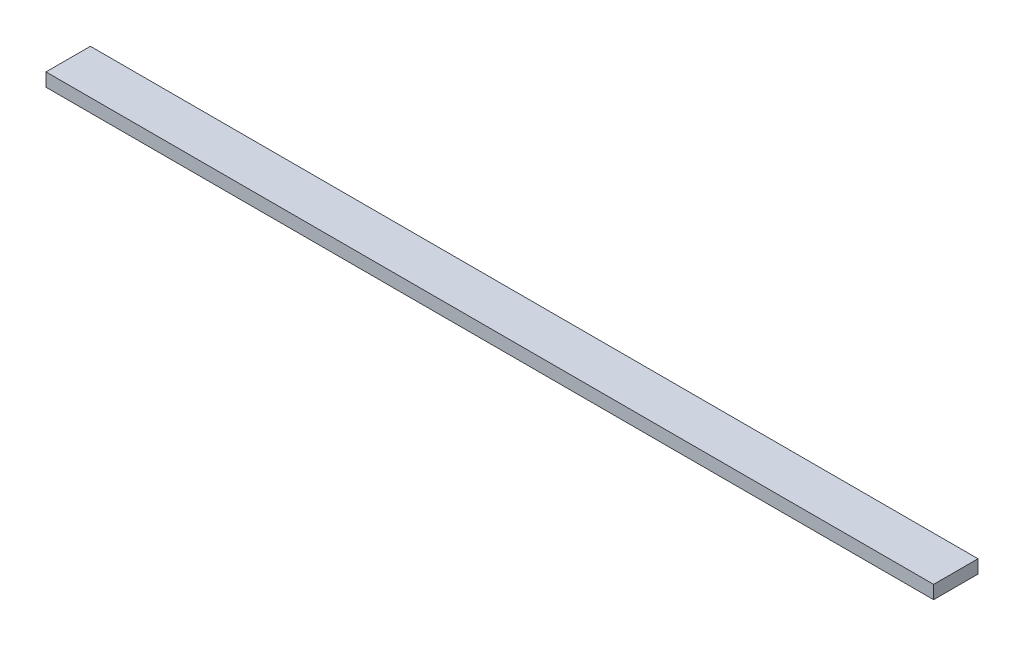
ISO-10303-21;
HEADER;
FILE_DESCRIPTION(('STEP AP214'),'2;1');
FILE_NAME('part.step','',(''),(''),'','','');
FILE_SCHEMA(('AUTOMOTIVE_DESIGN { 1 0 10303 214 1 1 1 1 }'));
ENDSEC;
DATA;
#1=APPLICATION_CONTEXT('core data for automotive mechanical design processes');
#2=APPLICATION_PROTOCOL_DEFINITION('international standard','automotive_design',2000,#1);
#3=PRODUCT_CONTEXT('',#1,'mechanical');
#4=PRODUCT('Part','Part','',(#3));
#5=PRODUCT_RELATED_PRODUCT_CATEGORY('part','',(#4));
#6=PRODUCT_DEFINITION_FORMATION('','',#4);
#7=PRODUCT_DEFINITION_CONTEXT('part definition',#1,'design');
#8=PRODUCT_DEFINITION('design','',#6,#7);
#9=PRODUCT_DEFINITION_SHAPE('','',#8);
#10=(LENGTH_UNIT() NAMED_UNIT(*) SI_UNIT(.MILLI.,.METRE.));
#11=(NAMED_UNIT(*) PLANE_ANGLE_UNIT() SI_UNIT($,.RADIAN.));
#12=(NAMED_UNIT(*) SI_UNIT($,.STERADIAN.) SOLID_ANGLE_UNIT());
#13=UNCERTAINTY_MEASURE_WITH_UNIT(LENGTH_MEASURE(1.E-05),#10,'distance_accuracy_value','');
#14=(GEOMETRIC_REPRESENTATION_CONTEXT(3) GLOBAL_UNCERTAINTY_ASSIGNED_CONTEXT((#13)) GLOBAL_UNIT_ASSIGNED_CONTEXT((#10,
#11,#12)) REPRESENTATION_CONTEXT('',''));
#15=CARTESIAN_POINT('',(0.,0.,0.));
#16=DIRECTION('',(0.,0.,1.));
#17=DIRECTION('',(1.,0.,0.));
#18=AXIS2_PLACEMENT_3D('',#15,#16,#17);
#19=CARTESIAN_POINT('',(0.,0.,500.));
#20=DIRECTION('',(1.,0.,0.));
#21=DIRECTION('',(0.,1.,0.));
#22=AXIS2_PLACEMENT_3D('',#19,#20,#21);
#23=PLANE('',#22);
#24=DIRECTION('',(0.,-1.,0.));
#25=VECTOR('',#24,1.);
#26=CARTESIAN_POINT('',(0.,0.,0.));
#27=LINE('',#26,#25);
#28=CARTESIAN_POINT('',(0.,0.,0.));
#29=VERTEX_POINT('',#28);
#30=CARTESIAN_POINT('',(0.,-150.,0.));
#31=VERTEX_POINT('',#30);
#32=EDGE_CURVE('E76',#29,#31,#27,.T.);
#33=ORIENTED_EDGE('',*,*,#32,.T.);
#34=DIRECTION('',(0.,0.,-1.));
#35=VECTOR('',#34,1.);
#36=CARTESIAN_POINT('',(0.,-150.,500.));
#37=LINE('',#36,#35);
#38=CARTESIAN_POINT('',(0.,-150.,500.));
#39=VERTEX_POINT('',#38);
#40=EDGE_CURVE('E11',#39,#31,#37,.T.);
#41=ORIENTED_EDGE('',*,*,#40,.F.);
#42=DIRECTION('',(0.,-1.,0.));
#43=VECTOR('',#42,1.);
#44=CARTESIAN_POINT('',(0.,0.,500.));
#45=LINE('',#44,#43);
#46=CARTESIAN_POINT('',(0.,0.,500.));
#47=VERTEX_POINT('',#46);
#48=EDGE_CURVE('E94',#47,#39,#45,.T.);
#49=ORIENTED_EDGE('',*,*,#48,.F.);
#50=DIRECTION('',(0.,0.,-1.));
#51=VECTOR('',#50,1.);
#52=CARTESIAN_POINT('',(0.,0.,500.));
#53=LINE('',#52,#51);
#54=EDGE_CURVE('E88',#47,#29,#53,.T.);
#55=ORIENTED_EDGE('',*,*,#54,.T.);
#56=EDGE_LOOP('',(#33,#41,#49,#55));
#57=FACE_BOUND('',#56,.T.);
#58=ADVANCED_FACE('F32',(#57),#23,.F.);
#59=CARTESIAN_POINT('',(0.,-150.,500.));
#60=DIRECTION('',(0.,1.,0.));
#61=DIRECTION('',(0.,0.,1.));
#62=AXIS2_PLACEMENT_3D('',#59,#60,#61);
#63=PLANE('',#62);
#64=DIRECTION('',(1.,0.,0.));
#65=VECTOR('',#64,1.);
#66=CARTESIAN_POINT('',(0.,-150.,0.));
#67=LINE('',#66,#65);
#68=CARTESIAN_POINT('',(10000.,-150.,0.));
#69=VERTEX_POINT('',#68);
#70=EDGE_CURVE('E72',#31,#69,#67,.T.);
#71=ORIENTED_EDGE('',*,*,#70,.T.);
#72=DIRECTION('',(0.,0.,-1.));
#73=VECTOR('',#72,1.);
#74=CARTESIAN_POINT('',(10000.,-150.,500.));
#75=LINE('',#74,#73);
#76=CARTESIAN_POINT('',(10000.,-150.,500.));
#77=VERTEX_POINT('',#76);
#78=EDGE_CURVE('E39',#77,#69,#75,.T.);
#79=ORIENTED_EDGE('',*,*,#78,.F.);
#80=DIRECTION('',(1.,0.,0.));
#81=VECTOR('',#80,1.);
#82=CARTESIAN_POINT('',(0.,-150.,500.));
#83=LINE('',#82,#81);
#84=EDGE_CURVE('E84',#39,#77,#83,.T.);
#85=ORIENTED_EDGE('',*,*,#84,.F.);
#86=ORIENTED_EDGE('',*,*,#40,.T.);
#87=EDGE_LOOP('',(#71,#79,#85,#86));
#88=FACE_BOUND('',#87,.T.);
#89=ADVANCED_FACE('F83',(#88),#63,.F.);
#90=CARTESIAN_POINT('',(10000.,0.,500.));
#91=DIRECTION('',(-1.,0.,0.));
#92=DIRECTION('',(0.,0.,1.));
#93=AXIS2_PLACEMENT_3D('',#90,#91,#92);
#94=PLANE('',#93);
#95=DIRECTION('',(0.,1.,0.));
#96=VECTOR('',#95,1.);
#97=CARTESIAN_POINT('',(10000.,0.,0.));
#98=LINE('',#97,#96);
#99=CARTESIAN_POINT('',(10000.,0.,0.));
#100=VERTEX_POINT('',#99);
#101=EDGE_CURVE('E77',#69,#100,#98,.T.);
#102=ORIENTED_EDGE('',*,*,#101,.T.);
#103=DIRECTION('',(0.,0.,-1.));
#104=VECTOR('',#103,1.);
#105=CARTESIAN_POINT('',(10000.,0.,500.));
#106=LINE('',#105,#104);
#107=CARTESIAN_POINT('',(10000.,0.,500.));
#108=VERTEX_POINT('',#107);
#109=EDGE_CURVE('E100',#108,#100,#106,.T.);
#110=ORIENTED_EDGE('',*,*,#109,.F.);
#111=DIRECTION('',(0.,1.,0.));
#112=VECTOR('',#111,1.);
#113=CARTESIAN_POINT('',(10000.,0.,500.));
#114=LINE('',#113,#112);
#115=EDGE_CURVE('E51',#77,#108,#114,.T.);
#116=ORIENTED_EDGE('',*,*,#115,.F.);
#117=ORIENTED_EDGE('',*,*,#78,.T.);
#118=EDGE_LOOP('',(#102,#110,#116,#117));
#119=FACE_BOUND('',#118,.T.);
#120=ADVANCED_FACE('F103',(#119),#94,.F.);
#121=CARTESIAN_POINT('',(0.,0.,500.));
#122=DIRECTION('',(0.,-1.,0.));
#123=DIRECTION('',(0.,0.,-1.));
#124=AXIS2_PLACEMENT_3D('',#121,#122,#123);
#125=PLANE('',#124);
#126=DIRECTION('',(-1.,0.,0.));
#127=VECTOR('',#126,1.);
#128=CARTESIAN_POINT('',(0.,0.,0.));
#129=LINE('',#128,#127);
#130=EDGE_CURVE('E92',#100,#29,#129,.T.);
#131=ORIENTED_EDGE('',*,*,#130,.T.);
#132=ORIENTED_EDGE('',*,*,#54,.F.);
#133=DIRECTION('',(-1.,0.,0.));
#134=VECTOR('',#133,1.);
#135=CARTESIAN_POINT('',(0.,0.,500.));
#136=LINE('',#135,#134);
#137=EDGE_CURVE('E46',#108,#47,#136,.T.);
#138=ORIENTED_EDGE('',*,*,#137,.F.);
#139=ORIENTED_EDGE('',*,*,#109,.T.);
#140=EDGE_LOOP('',(#131,#132,#138,#139));
#141=FACE_BOUND('',#140,.T.);
#142=ADVANCED_FACE('F105',(#141),#125,.F.);
#143=CARTESIAN_POINT('',(0.,-150.,500.));
#144=DIRECTION('',(0.,0.,1.));
#145=DIRECTION('',(1.,0.,0.));
#146=AXIS2_PLACEMENT_3D('',#143,#144,#145);
#147=PLANE('',#146);
#148=ORIENTED_EDGE('',*,*,#48,.T.);
#149=ORIENTED_EDGE('',*,*,#84,.T.);
#150=ORIENTED_EDGE('',*,*,#115,.T.);
#151=ORIENTED_EDGE('',*,*,#137,.T.);
#152=EDGE_LOOP('',(#148,#149,#150,#151));
#153=FACE_BOUND('',#152,.T.);
#154=ADVANCED_FACE('F106',(#153),#147,.T.);
#155=CARTESIAN_POINT('',(0.,-150.,0.));
#156=DIRECTION('',(0.,0.,1.));
#157=DIRECTION('',(1.,0.,0.));
#158=AXIS2_PLACEMENT_3D('',#155,#156,#157);
#159=PLANE('',#158);
#160=ORIENTED_EDGE('',*,*,#32,.F.);
#161=ORIENTED_EDGE('',*,*,#130,.F.);
#162=ORIENTED_EDGE('',*,*,#101,.F.);
#163=ORIENTED_EDGE('',*,*,#70,.F.);
#164=EDGE_LOOP('',(#160,#161,#162,#163));
#165=FACE_BOUND('',#164,.T.);
#166=ADVANCED_FACE('F73',(#165),#159,.F.);
#167=CLOSED_SHELL('',(#58,#89,#120,#142,#154,#166));
#168=MANIFOLD_SOLID_BREP('B2',#167);
#169=ADVANCED_BREP_SHAPE_REPRESENTATION('',(#18,#168),#14);
#170=SHAPE_DEFINITION_REPRESENTATION(#9,#169);
ENDSEC;
END-ISO-10303-21;
